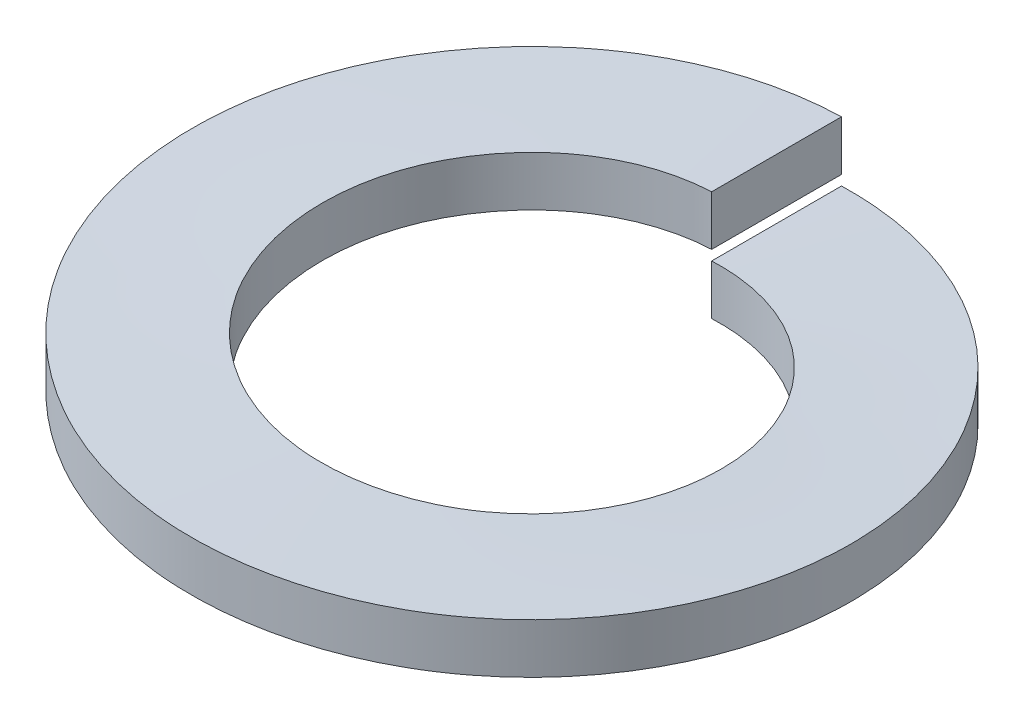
from build123d import *

# Parameters (mm, degrees)
BALAYAGE1_PITCH       = 0.6
BALAYAGE1_HEIGHT      = 0.6
BALAYAGE1_RADIUS      = 2.5
BALAYAGE1_START_ANGLE = -180
ESQUISSE2_W           = 1.3
ESQUISSE2_H           = 0.5


with BuildPart() as part:
    # Balayage1: sweep along a helix
    with BuildLine() as balayage1_path:
        add(Helix(BALAYAGE1_PITCH, BALAYAGE1_HEIGHT, BALAYAGE1_RADIUS, center=(0, 0, 0), direction=(0, 1, 0), lefthand=True, mode=Mode.PRIVATE).rotate(Axis((0, 0, 0), (0, 1, 0)), BALAYAGE1_START_ANGLE))
    # Esquisse2 → Balayage1 (sweep)
    with BuildSketch(Plane(origin=(0, 0, 0), x_dir=(0, 0, -1), z_dir=(1, 0, 0))):
        with Locations((2.65, 0.6)):
            Rectangle(ESQUISSE2_W, ESQUISSE2_H)
    sweep(path=balayage1_path.line, is_frenet=True)


solid = part.part
